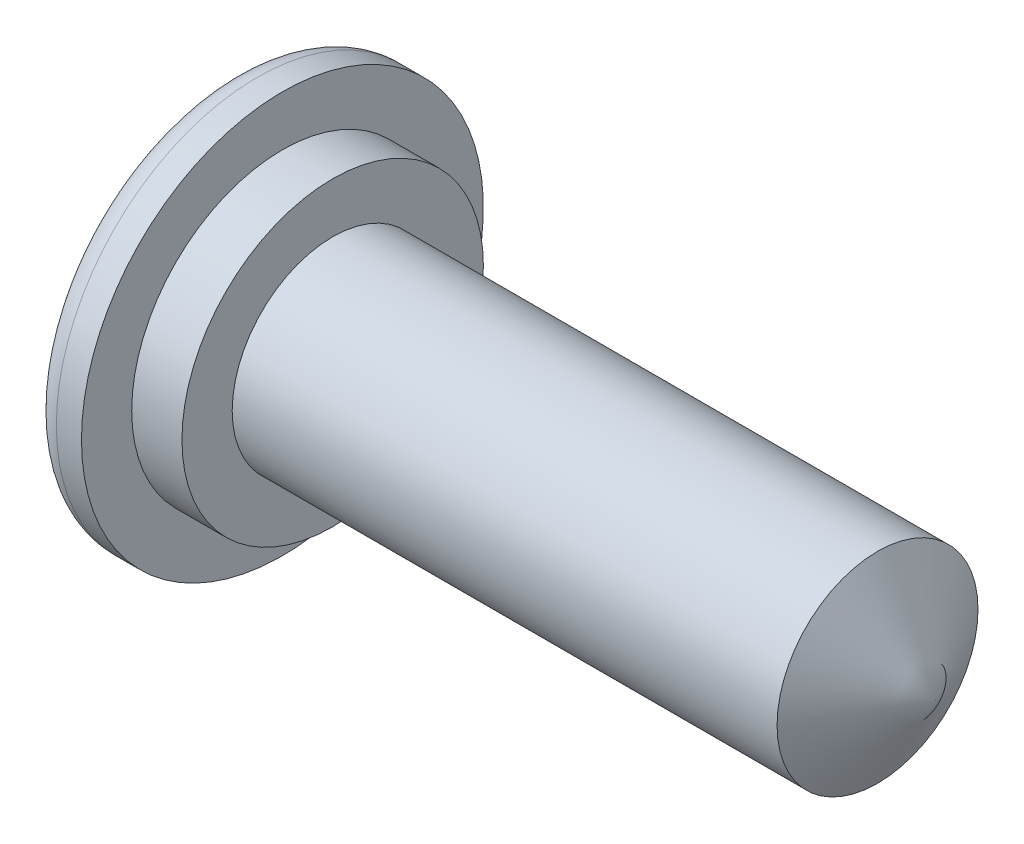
from build123d import *


with BuildPart() as part:
    # Esquisse1 → R_volution1 (revolve)
    with BuildSketch(Plane.XY, mode=Mode.PRIVATE) as r_volution1_sk:
        with BuildLine():
            Line((0, 3), (1, 3))
            Line((1, 3), (1, 2))
            Line((1, 2), (11.845299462, 2))
            Line((11.845299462, 2), (13, 0))
            Line((13, 0), (1.154700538, 0))
            Line((1.154700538, 0), (0, 2))
            Line((0, 2), (-0.5, 2))
            ThreePointArc((-0.5, 2), (-0.853553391, 2.146446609), (-1, 2.5))
            Line((-1, 2.5), (-1, 3.5))
            ThreePointArc((-1, 3.5), (-0.853553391, 3.853553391), (-0.5, 4))
            Line((-0.5, 4), (0, 4))
            Line((0, 4), (0, 3))
        make_face()
    revolve(r_volution1_sk.sketch.rotate(Axis((-8.537570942, 0, 0), (1, 0, 0)), 90), axis=Axis((-8.537570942, 0, 0), (1, 0, 0)))


solid = part.part
